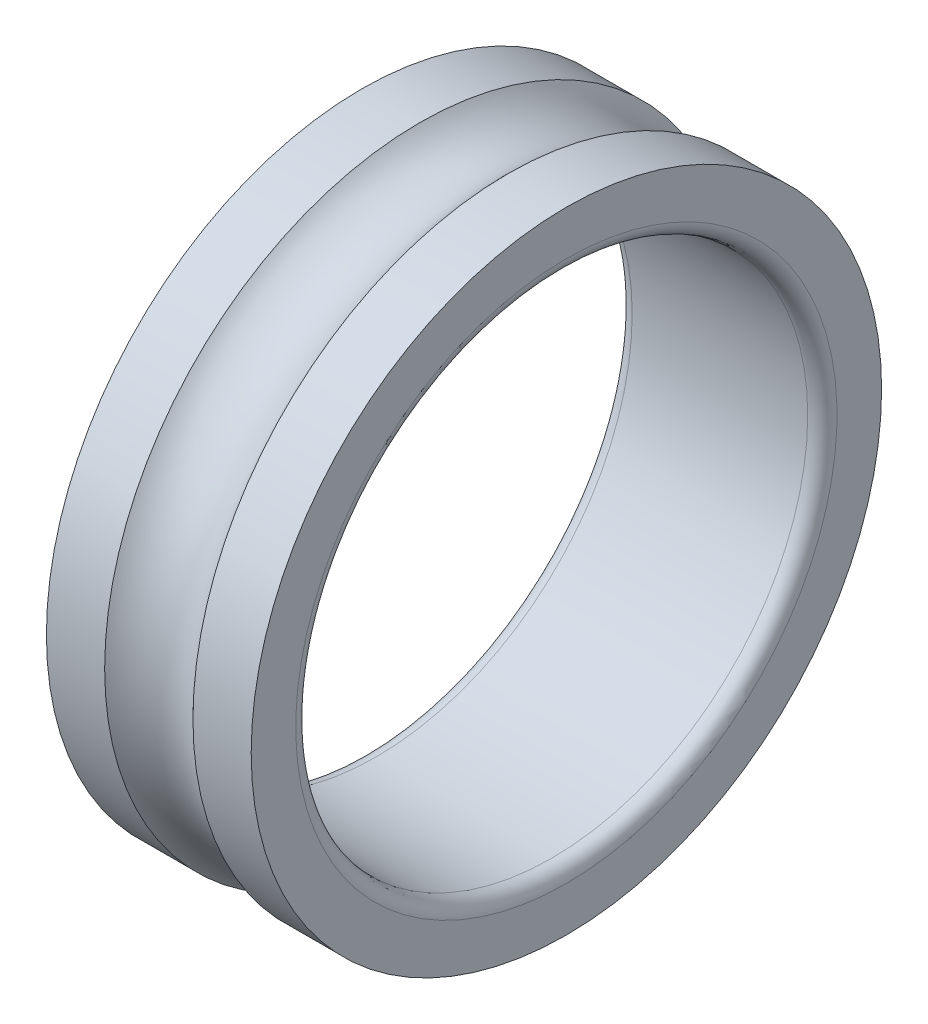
from build123d import *


with BuildPart() as part:
    # Esquisse1 → R_volution1 (revolve)
    with BuildSketch(Plane.XY, mode=Mode.PRIVATE) as r_volution1_sk:
        with BuildLine():
            Line((1, 17.5), (13, 17.5))
            ThreePointArc((13, 17.5), (13.707106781, 17.792893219), (14, 18.5))
            Line((14, 18.5), (14, 21.55))
            Line((14, 21.55), (10.01869177, 21.55))
            ThreePointArc((10.01869177, 21.55), (7, 20.2), (3.98130823, 21.55))
            Line((3.98130823, 21.55), (0, 21.55))
            Line((0, 21.55), (0, 18.5))
            ThreePointArc((0, 18.5), (0.292893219, 17.792893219), (1, 17.5))
        make_face()
    revolve(r_volution1_sk.sketch.rotate(Axis((0, 0, 0), (1, 0, 0)), 180), axis=Axis((0, 0, 0), (1, 0, 0)))


solid = part.part
